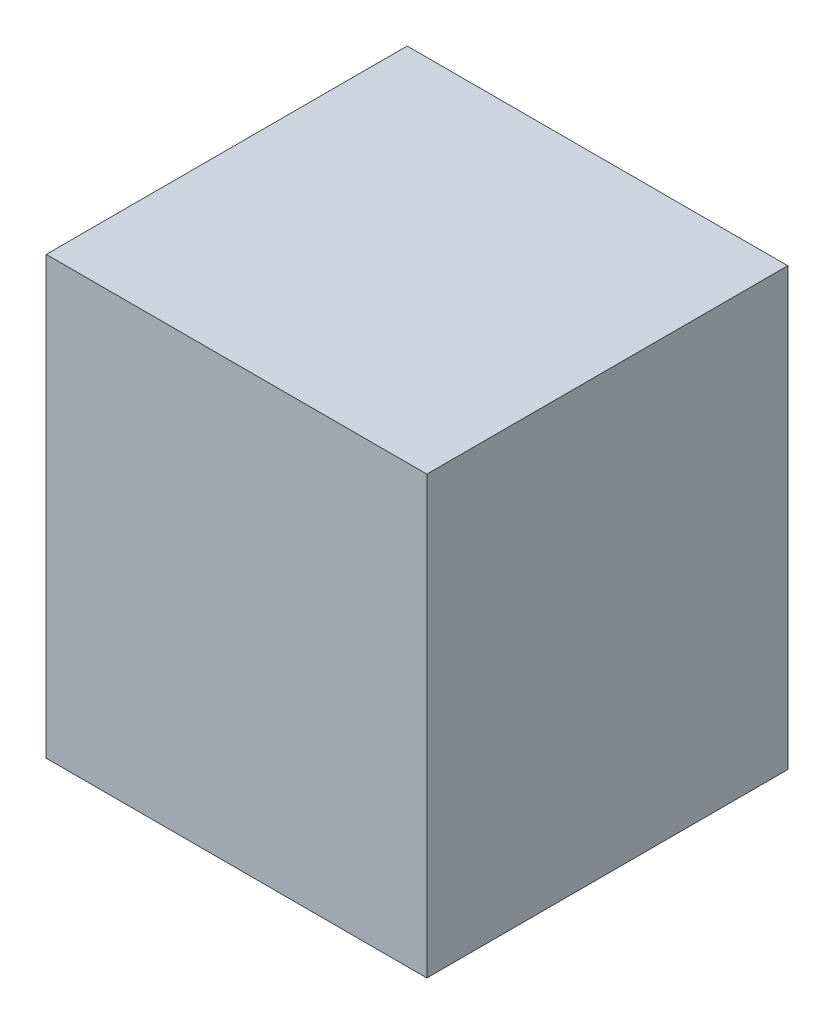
ISO-10303-21;
HEADER;
FILE_DESCRIPTION(('STEP AP214'),'2;1');
FILE_NAME('part.step','',(''),(''),'','','');
FILE_SCHEMA(('AUTOMOTIVE_DESIGN { 1 0 10303 214 1 1 1 1 }'));
ENDSEC;
DATA;
#1=APPLICATION_CONTEXT('core data for automotive mechanical design processes');
#2=APPLICATION_PROTOCOL_DEFINITION('international standard','automotive_design',2000,#1);
#3=PRODUCT_CONTEXT('',#1,'mechanical');
#4=PRODUCT('Part','Part','',(#3));
#5=PRODUCT_RELATED_PRODUCT_CATEGORY('part','',(#4));
#6=PRODUCT_DEFINITION_FORMATION('','',#4);
#7=PRODUCT_DEFINITION_CONTEXT('part definition',#1,'design');
#8=PRODUCT_DEFINITION('design','',#6,#7);
#9=PRODUCT_DEFINITION_SHAPE('','',#8);
#10=(LENGTH_UNIT() NAMED_UNIT(*) SI_UNIT(.MILLI.,.METRE.));
#11=(NAMED_UNIT(*) PLANE_ANGLE_UNIT() SI_UNIT($,.RADIAN.));
#12=(NAMED_UNIT(*) SI_UNIT($,.STERADIAN.) SOLID_ANGLE_UNIT());
#13=UNCERTAINTY_MEASURE_WITH_UNIT(LENGTH_MEASURE(1.E-05),#10,'distance_accuracy_value','');
#14=(GEOMETRIC_REPRESENTATION_CONTEXT(3) GLOBAL_UNCERTAINTY_ASSIGNED_CONTEXT((#13)) GLOBAL_UNIT_ASSIGNED_CONTEXT((#10,
#11,#12)) REPRESENTATION_CONTEXT('',''));
#15=CARTESIAN_POINT('',(0.,0.,0.));
#16=DIRECTION('',(0.,0.,1.));
#17=DIRECTION('',(1.,0.,0.));
#18=AXIS2_PLACEMENT_3D('',#15,#16,#17);
#19=CARTESIAN_POINT('',(84.851402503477,194.564,-80.4625368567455));
#20=DIRECTION('',(-1.,0.,0.));
#21=DIRECTION('',(0.,0.,1.));
#22=AXIS2_PLACEMENT_3D('',#19,#20,#21);
#23=PLANE('',#22);
#24=DIRECTION('',(0.,0.,-1.));
#25=VECTOR('',#24,1.);
#26=CARTESIAN_POINT('',(84.851402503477,0.,-80.4625368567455));
#27=LINE('',#26,#25);
#28=CARTESIAN_POINT('',(84.851402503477,0.,80.4625368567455));
#29=VERTEX_POINT('',#28);
#30=CARTESIAN_POINT('',(84.851402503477,0.,-80.4625368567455));
#31=VERTEX_POINT('',#30);
#32=EDGE_CURVE('E93',#29,#31,#27,.T.);
#33=ORIENTED_EDGE('',*,*,#32,.T.);
#34=DIRECTION('',(0.,-1.,0.));
#35=VECTOR('',#34,1.);
#36=CARTESIAN_POINT('',(84.851402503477,194.564,-80.4625368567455));
#37=LINE('',#36,#35);
#38=CARTESIAN_POINT('',(84.851402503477,194.564,-80.4625368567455));
#39=VERTEX_POINT('',#38);
#40=EDGE_CURVE('E11',#39,#31,#37,.T.);
#41=ORIENTED_EDGE('',*,*,#40,.F.);
#42=DIRECTION('',(0.,0.,-1.));
#43=VECTOR('',#42,1.);
#44=CARTESIAN_POINT('',(84.851402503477,194.564,-80.4625368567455));
#45=LINE('',#44,#43);
#46=CARTESIAN_POINT('',(84.851402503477,194.564,80.4625368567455));
#47=VERTEX_POINT('',#46);
#48=EDGE_CURVE('E81',#47,#39,#45,.T.);
#49=ORIENTED_EDGE('',*,*,#48,.F.);
#50=DIRECTION('',(0.,-1.,0.));
#51=VECTOR('',#50,1.);
#52=CARTESIAN_POINT('',(84.851402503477,194.564,80.4625368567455));
#53=LINE('',#52,#51);
#54=EDGE_CURVE('E89',#47,#29,#53,.T.);
#55=ORIENTED_EDGE('',*,*,#54,.T.);
#56=EDGE_LOOP('',(#33,#41,#49,#55));
#57=FACE_BOUND('',#56,.T.);
#58=ADVANCED_FACE('F30',(#57),#23,.F.);
#59=CARTESIAN_POINT('',(-84.851402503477,194.564,-80.4625368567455));
#60=DIRECTION('',(0.,0.,1.));
#61=DIRECTION('',(1.,0.,0.));
#62=AXIS2_PLACEMENT_3D('',#59,#60,#61);
#63=PLANE('',#62);
#64=DIRECTION('',(-1.,0.,0.));
#65=VECTOR('',#64,1.);
#66=CARTESIAN_POINT('',(-84.851402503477,0.,-80.4625368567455));
#67=LINE('',#66,#65);
#68=CARTESIAN_POINT('',(-84.851402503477,0.,-80.4625368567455));
#69=VERTEX_POINT('',#68);
#70=EDGE_CURVE('E85',#31,#69,#67,.T.);
#71=ORIENTED_EDGE('',*,*,#70,.T.);
#72=DIRECTION('',(0.,-1.,0.));
#73=VECTOR('',#72,1.);
#74=CARTESIAN_POINT('',(-84.851402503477,194.564,-80.4625368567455));
#75=LINE('',#74,#73);
#76=CARTESIAN_POINT('',(-84.851402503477,194.564,-80.4625368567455));
#77=VERTEX_POINT('',#76);
#78=EDGE_CURVE('E38',#77,#69,#75,.T.);
#79=ORIENTED_EDGE('',*,*,#78,.F.);
#80=DIRECTION('',(-1.,0.,0.));
#81=VECTOR('',#80,1.);
#82=CARTESIAN_POINT('',(-84.851402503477,194.564,-80.4625368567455));
#83=LINE('',#82,#81);
#84=EDGE_CURVE('E76',#39,#77,#83,.T.);
#85=ORIENTED_EDGE('',*,*,#84,.F.);
#86=ORIENTED_EDGE('',*,*,#40,.T.);
#87=EDGE_LOOP('',(#71,#79,#85,#86));
#88=FACE_BOUND('',#87,.T.);
#89=ADVANCED_FACE('F84',(#88),#63,.F.);
#90=CARTESIAN_POINT('',(-84.851402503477,194.564,-80.4625368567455));
#91=DIRECTION('',(1.,0.,0.));
#92=DIRECTION('',(0.,0.,-1.));
#93=AXIS2_PLACEMENT_3D('',#90,#91,#92);
#94=PLANE('',#93);
#95=DIRECTION('',(0.,0.,1.));
#96=VECTOR('',#95,1.);
#97=CARTESIAN_POINT('',(-84.851402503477,0.,-80.4625368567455));
#98=LINE('',#97,#96);
#99=CARTESIAN_POINT('',(-84.851402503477,0.,80.4625368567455));
#100=VERTEX_POINT('',#99);
#101=EDGE_CURVE('E63',#69,#100,#98,.T.);
#102=ORIENTED_EDGE('',*,*,#101,.T.);
#103=DIRECTION('',(0.,-1.,0.));
#104=VECTOR('',#103,1.);
#105=CARTESIAN_POINT('',(-84.851402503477,194.564,80.4625368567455));
#106=LINE('',#105,#104);
#107=CARTESIAN_POINT('',(-84.851402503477,194.564,80.4625368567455));
#108=VERTEX_POINT('',#107);
#109=EDGE_CURVE('E86',#108,#100,#106,.T.);
#110=ORIENTED_EDGE('',*,*,#109,.F.);
#111=DIRECTION('',(0.,0.,1.));
#112=VECTOR('',#111,1.);
#113=CARTESIAN_POINT('',(-84.851402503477,194.564,-80.4625368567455));
#114=LINE('',#113,#112);
#115=EDGE_CURVE('E79',#77,#108,#114,.T.);
#116=ORIENTED_EDGE('',*,*,#115,.F.);
#117=ORIENTED_EDGE('',*,*,#78,.T.);
#118=EDGE_LOOP('',(#102,#110,#116,#117));
#119=FACE_BOUND('',#118,.T.);
#120=ADVANCED_FACE('F87',(#119),#94,.F.);
#121=CARTESIAN_POINT('',(-84.851402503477,194.564,80.4625368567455));
#122=DIRECTION('',(0.,0.,-1.));
#123=DIRECTION('',(-1.,0.,0.));
#124=AXIS2_PLACEMENT_3D('',#121,#122,#123);
#125=PLANE('',#124);
#126=DIRECTION('',(1.,0.,0.));
#127=VECTOR('',#126,1.);
#128=CARTESIAN_POINT('',(-84.851402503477,0.,80.4625368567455));
#129=LINE('',#128,#127);
#130=EDGE_CURVE('E69',#100,#29,#129,.T.);
#131=ORIENTED_EDGE('',*,*,#130,.T.);
#132=ORIENTED_EDGE('',*,*,#54,.F.);
#133=DIRECTION('',(1.,0.,0.));
#134=VECTOR('',#133,1.);
#135=CARTESIAN_POINT('',(-84.851402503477,194.564,80.4625368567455));
#136=LINE('',#135,#134);
#137=EDGE_CURVE('E46',#108,#47,#136,.T.);
#138=ORIENTED_EDGE('',*,*,#137,.F.);
#139=ORIENTED_EDGE('',*,*,#109,.T.);
#140=EDGE_LOOP('',(#131,#132,#138,#139));
#141=FACE_BOUND('',#140,.T.);
#142=ADVANCED_FACE('F100',(#141),#125,.F.);
#143=CARTESIAN_POINT('',(84.851402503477,194.564,80.4625368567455));
#144=DIRECTION('',(0.,1.,0.));
#145=DIRECTION('',(0.,0.,1.));
#146=AXIS2_PLACEMENT_3D('',#143,#144,#145);
#147=PLANE('',#146);
#148=ORIENTED_EDGE('',*,*,#48,.T.);
#149=ORIENTED_EDGE('',*,*,#84,.T.);
#150=ORIENTED_EDGE('',*,*,#115,.T.);
#151=ORIENTED_EDGE('',*,*,#137,.T.);
#152=EDGE_LOOP('',(#148,#149,#150,#151));
#153=FACE_BOUND('',#152,.T.);
#154=ADVANCED_FACE('F77',(#153),#147,.T.);
#155=CARTESIAN_POINT('',(84.851402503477,0.,80.4625368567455));
#156=DIRECTION('',(0.,1.,0.));
#157=DIRECTION('',(0.,0.,1.));
#158=AXIS2_PLACEMENT_3D('',#155,#156,#157);
#159=PLANE('',#158);
#160=ORIENTED_EDGE('',*,*,#32,.F.);
#161=ORIENTED_EDGE('',*,*,#130,.F.);
#162=ORIENTED_EDGE('',*,*,#101,.F.);
#163=ORIENTED_EDGE('',*,*,#70,.F.);
#164=EDGE_LOOP('',(#160,#161,#162,#163));
#165=FACE_BOUND('',#164,.T.);
#166=ADVANCED_FACE('F103',(#165),#159,.F.);
#167=CLOSED_SHELL('',(#58,#89,#120,#142,#154,#166));
#168=MANIFOLD_SOLID_BREP('B2',#167);
#169=ADVANCED_BREP_SHAPE_REPRESENTATION('',(#18,#168),#14);
#170=SHAPE_DEFINITION_REPRESENTATION(#9,#169);
ENDSEC;
END-ISO-10303-21;
